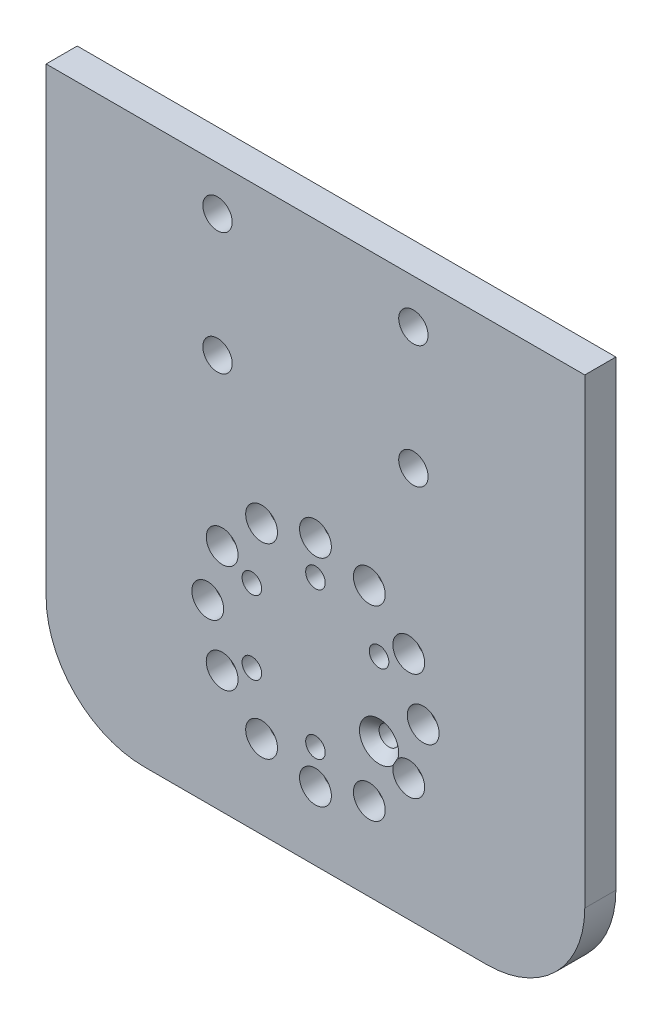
from build123d import *

# Parameters (mm, degrees)
SKETCH1_W           = 114.3
SKETCH1_H           = 110
SKETCH1_R           = 2
SKETCH1_R_2         = 1.5
SKETCH1_R_3         = 3
BOSS_EXTRUDE1_DEPTH = 6.35
FILLET1_R           = 20
SKETCH9_R           = 3.25
CUT_EXTRUDE2_DEPTH  = 4.5
CIRPATTERN2_COUNT   = 12


with BuildPart() as part:
    # Sketch1 → Boss-Extrude1 (new body)
    with BuildSketch(Plane(origin=(0, 0, 0), x_dir=(0, 1, 0), z_dir=(0, 0, 1))):
        with Locations((21.15, 0)):
            Rectangle(SKETCH1_W, SKETCH1_H)
        with Locations(Location((15, 0, 0), (0, 0, 270))):
            Circle(SKETCH1_R, mode=Mode.SUBTRACT)
        with Locations(Location((7.5, -12.990381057, 0), (0, 0, 270))):
            Circle(SKETCH1_R, mode=Mode.SUBTRACT)
        with Locations(Location((-7.5, -12.990381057, 0), (0, 0, 270))):
            Circle(SKETCH1_R, mode=Mode.SUBTRACT)
        with Locations(Location((-15, 0, 0), (0, 0, 270))):
            Circle(SKETCH1_R, mode=Mode.SUBTRACT)
        with Locations(Location((-7.5, 12.990381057, 0), (0, 0, 270))):
            Circle(SKETCH1_R, mode=Mode.SUBTRACT)
        with Locations(Location((7.5, 12.990381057, 0), (0, 0, 270))):
            Circle(SKETCH1_R, mode=Mode.SUBTRACT)
        with Locations(Location((22, 0, 0), (0, 0, 270))):
            Circle(SKETCH1_R_2, mode=Mode.SUBTRACT)
        with Locations(Location((19.052558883, -11, 0), (0, 0, 270))):
            Circle(SKETCH1_R_2, mode=Mode.SUBTRACT)
        with Locations(Location((11, -19.052558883, 0), (0, 0, 270))):
            Circle(SKETCH1_R_2, mode=Mode.SUBTRACT)
        with Locations(Location((0, -22, 0), (0, 0, 270))):
            Circle(SKETCH1_R_2, mode=Mode.SUBTRACT)
        with Locations(Location((-11, -19.052558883, 0), (0, 0, 270))):
            Circle(SKETCH1_R_2, mode=Mode.SUBTRACT)
        with Locations(Location((-19.052558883, -11, 0), (0, 0, 270))):
            Circle(SKETCH1_R_2, mode=Mode.SUBTRACT)
        with Locations(Location((-22, 0, 0), (0, 0, 270))):
            Circle(SKETCH1_R_2, mode=Mode.SUBTRACT)
        with Locations(Location((-19.052558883, 11, 0), (0, 0, 270))):
            Circle(SKETCH1_R_2, mode=Mode.SUBTRACT)
        with Locations(Location((-11, 19.052558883, 0), (0, 0, 270))):
            Circle(SKETCH1_R_2, mode=Mode.SUBTRACT)
        with Locations(Location((0, 22, 0), (0, 0, 270))):
            Circle(SKETCH1_R_2, mode=Mode.SUBTRACT)
        with Locations(Location((11, 19.052558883, 0), (0, 0, 270))):
            Circle(SKETCH1_R_2, mode=Mode.SUBTRACT)
        with Locations(Location((19.052558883, 11, 0), (0, 0, 270))):
            Circle(SKETCH1_R_2, mode=Mode.SUBTRACT)
        with Locations(Location((69.3, 20, 0), (0, 0, 270))):
            Circle(SKETCH1_R_3, mode=Mode.SUBTRACT)
        with Locations(Location((44.3, 20, 0), (0, 0, 270))):
            Circle(SKETCH1_R_3, mode=Mode.SUBTRACT)
        with Locations(Location((44.3, -20, 0), (0, 0, 270))):
            Circle(SKETCH1_R_3, mode=Mode.SUBTRACT)
        with Locations(Location((69.3, -20, 0), (0, 0, 270))):
            Circle(SKETCH1_R_3, mode=Mode.SUBTRACT)
    extrude(amount=BOSS_EXTRUDE1_DEPTH)

    # Fillet1
    fillet1_edges = [part.edges().sort_by_distance(p)[0] for p in [
        (-55, -36, 3.175),
        (55, -36, 3.175),
    ]]
    fillet(fillet1_edges, radius=FILLET1_R)

    # Sketch9 → Cut-Extrude2 (cut)
    with BuildSketch(Plane(origin=(0, 0, 6.35), x_dir=(0, -1, 0), z_dir=(0, 0, 1))):
        with Locations(Location((22, 0, 0), (0, 0, 90))):
            Circle(SKETCH9_R)
    cut_extrude2 = extrude(amount=-CUT_EXTRUDE2_DEPTH, mode=Mode.SUBTRACT)

    # CirPattern2: Cut-Extrude2 ×12 about axis
    cirpattern2_axis = Axis((0, 0, 0), (0, 0, 1))
    for i in range(1, CIRPATTERN2_COUNT):
        add(cut_extrude2.rotate(cirpattern2_axis, i * 360 / CIRPATTERN2_COUNT), mode=Mode.SUBTRACT)

    # Sketch12 → Cut-Revolve2 (revolve, cut)
    with BuildSketch(Plane(origin=(0, 0, 0), x_dir=(0.8660254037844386, -0.4999999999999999, 0), z_dir=(-0.49999999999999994, -0.8660254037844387, 0)), mode=Mode.PRIVATE) as cut_revolve2_sk:
        Polygon((15, 6.35), (19, 6.35), (17, 4.35), (15, 4.35), align=None)
    revolve(cut_revolve2_sk.sketch.rotate(Axis((12.990381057, -7.5, 4.35), (0, 0, 1)), 210), axis=Axis((12.990381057, -7.5, 4.35), (0, 0, 1)), mode=Mode.SUBTRACT)


solid = part.part
